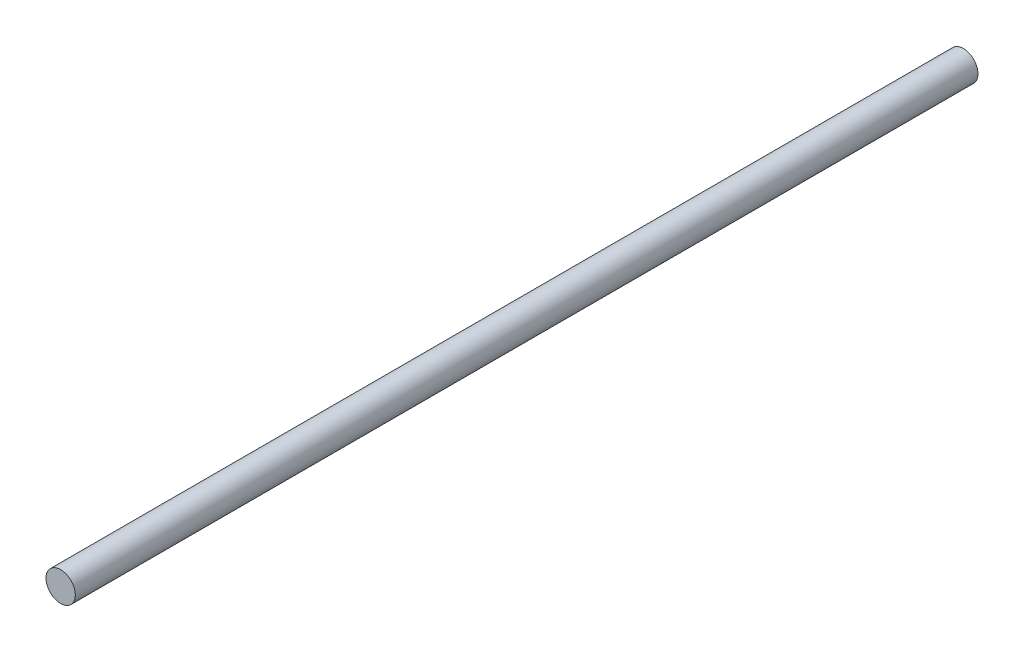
from build123d import *

# Parameters (mm, degrees)
SKETCH1_R           = 31.73095
BOSS_EXTRUDE1_DEPTH = 1952.752


with BuildPart() as part:
    # Sketch1 → Boss-Extrude1 (new body)
    with BuildSketch(Plane.XY):
        Circle(SKETCH1_R)
    extrude(amount=BOSS_EXTRUDE1_DEPTH)


solid = part.part
